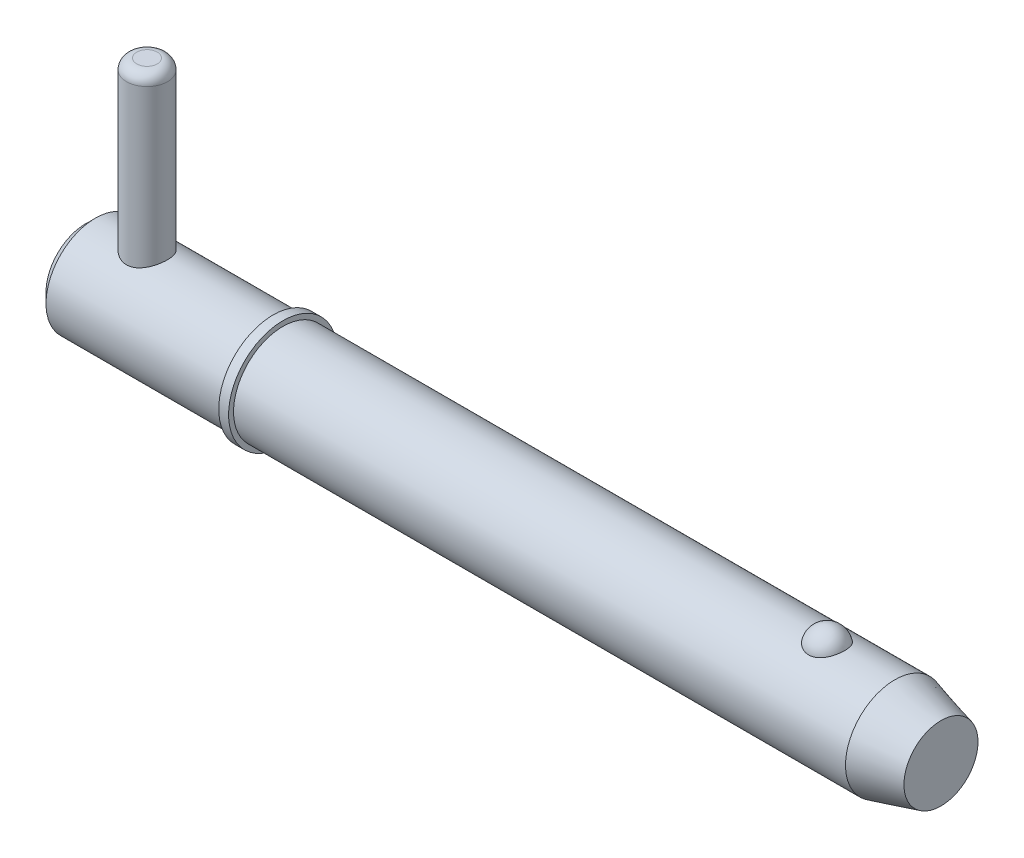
ISO-10303-21;
HEADER;
FILE_DESCRIPTION(('STEP AP214'),'2;1');
FILE_NAME('part.step','',(''),(''),'','','');
FILE_SCHEMA(('AUTOMOTIVE_DESIGN { 1 0 10303 214 1 1 1 1 }'));
ENDSEC;
DATA;
#1=APPLICATION_CONTEXT('core data for automotive mechanical design processes');
#2=APPLICATION_PROTOCOL_DEFINITION('international standard','automotive_design',2000,#1);
#3=PRODUCT_CONTEXT('',#1,'mechanical');
#4=PRODUCT('Part','Part','',(#3));
#5=PRODUCT_RELATED_PRODUCT_CATEGORY('part','',(#4));
#6=PRODUCT_DEFINITION_FORMATION('','',#4);
#7=PRODUCT_DEFINITION_CONTEXT('part definition',#1,'design');
#8=PRODUCT_DEFINITION('design','',#6,#7);
#9=PRODUCT_DEFINITION_SHAPE('','',#8);
#10=(LENGTH_UNIT() NAMED_UNIT(*) SI_UNIT(.MILLI.,.METRE.));
#11=(NAMED_UNIT(*) PLANE_ANGLE_UNIT() SI_UNIT($,.RADIAN.));
#12=(NAMED_UNIT(*) SI_UNIT($,.STERADIAN.) SOLID_ANGLE_UNIT());
#13=UNCERTAINTY_MEASURE_WITH_UNIT(LENGTH_MEASURE(1.E-05),#10,'distance_accuracy_value','');
#14=(GEOMETRIC_REPRESENTATION_CONTEXT(3) GLOBAL_UNCERTAINTY_ASSIGNED_CONTEXT((#13)) GLOBAL_UNIT_ASSIGNED_CONTEXT((#10,
#11,#12)) REPRESENTATION_CONTEXT('',''));
#15=CARTESIAN_POINT('',(0.,0.,0.));
#16=DIRECTION('',(0.,0.,1.));
#17=DIRECTION('',(1.,0.,0.));
#18=AXIS2_PLACEMENT_3D('',#15,#16,#17);
#19=CARTESIAN_POINT('',(5.94,20.635,0.));
#20=DIRECTION('',(0.,-1.,0.));
#21=DIRECTION('',(0.,0.,-1.));
#22=AXIS2_PLACEMENT_3D('',#19,#20,#21);
#23=CYLINDRICAL_SURFACE('',#22,1.98);
#24=CARTESIAN_POINT('',(5.94,-3.775,0.));
#25=DIRECTION('',(0.,1.,0.));
#26=DIRECTION('',(0.,0.,1.));
#27=AXIS2_PLACEMENT_3D('',#24,#25,#26);
#28=CIRCLE('',#27,1.98);
#29=CARTESIAN_POINT('',(5.94,-3.775,1.98));
#30=VERTEX_POINT('',#29);
#31=EDGE_CURVE('P0_E25',#30,#30,#28,.T.);
#32=ORIENTED_EDGE('',*,*,#31,.T.);
#33=EDGE_LOOP('',(#32));
#34=FACE_BOUND('',#33,.T.);
#35=CARTESIAN_POINT('',(5.94,19.645,0.));
#36=DIRECTION('',(0.,1.,0.));
#37=DIRECTION('',(0.,0.,1.));
#38=AXIS2_PLACEMENT_3D('',#35,#36,#37);
#39=CIRCLE('',#38,1.98);
#40=CARTESIAN_POINT('',(5.94,19.645,1.98));
#41=VERTEX_POINT('',#40);
#42=EDGE_CURVE('P0_E29',#41,#41,#39,.F.);
#43=ORIENTED_EDGE('',*,*,#42,.T.);
#44=EDGE_LOOP('',(#43));
#45=FACE_BOUND('',#44,.T.);
#46=ADVANCED_FACE('P0_F14',(#34,#45),#23,.T.);
#47=CARTESIAN_POINT('',(5.94,20.635,0.));
#48=DIRECTION('',(0.,1.,0.));
#49=DIRECTION('',(0.,0.,1.));
#50=AXIS2_PLACEMENT_3D('',#47,#48,#49);
#51=PLANE('',#50);
#52=CARTESIAN_POINT('',(5.94,20.635,0.));
#53=DIRECTION('',(0.,1.,0.));
#54=DIRECTION('',(0.,0.,1.));
#55=AXIS2_PLACEMENT_3D('',#52,#53,#54);
#56=CIRCLE('',#55,0.99);
#57=CARTESIAN_POINT('',(5.94,20.635,0.99));
#58=VERTEX_POINT('',#57);
#59=EDGE_CURVE('P0_E10',#58,#58,#56,.T.);
#60=ORIENTED_EDGE('',*,*,#59,.T.);
#61=EDGE_LOOP('',(#60));
#62=FACE_BOUND('',#61,.T.);
#63=ADVANCED_FACE('P0_F46',(#62),#51,.T.);
#64=CARTESIAN_POINT('',(5.94,-4.765,0.));
#65=DIRECTION('',(0.,1.,0.));
#66=DIRECTION('',(0.,0.,1.));
#67=AXIS2_PLACEMENT_3D('',#64,#65,#66);
#68=PLANE('',#67);
#69=CARTESIAN_POINT('',(5.94,-4.765,0.));
#70=DIRECTION('',(0.,1.,0.));
#71=DIRECTION('',(0.,0.,1.));
#72=AXIS2_PLACEMENT_3D('',#69,#70,#71);
#73=CIRCLE('',#72,0.99);
#74=CARTESIAN_POINT('',(5.94,-4.765,0.99));
#75=VERTEX_POINT('',#74);
#76=EDGE_CURVE('P0_E21',#75,#75,#73,.F.);
#77=ORIENTED_EDGE('',*,*,#76,.T.);
#78=EDGE_LOOP('',(#77));
#79=FACE_BOUND('',#78,.T.);
#80=ADVANCED_FACE('P0_F43',(#79),#68,.F.);
#81=CARTESIAN_POINT('',(5.94,-3.775,0.));
#82=DIRECTION('',(0.,1.,0.));
#83=DIRECTION('',(0.,0.,1.));
#84=AXIS2_PLACEMENT_3D('',#81,#82,#83);
#85=DEGENERATE_TOROIDAL_SURFACE('',#84,0.99,0.99,.T.);
#86=ORIENTED_EDGE('',*,*,#76,.F.);
#87=EDGE_LOOP('',(#86));
#88=FACE_BOUND('',#87,.T.);
#89=ORIENTED_EDGE('',*,*,#31,.F.);
#90=EDGE_LOOP('',(#89));
#91=FACE_BOUND('',#90,.T.);
#92=ADVANCED_FACE('P0_F38',(#88,#91),#85,.T.);
#93=CARTESIAN_POINT('',(5.94,19.645,0.));
#94=DIRECTION('',(0.,1.,0.));
#95=DIRECTION('',(0.,0.,1.));
#96=AXIS2_PLACEMENT_3D('',#93,#94,#95);
#97=DEGENERATE_TOROIDAL_SURFACE('',#96,0.99,0.99,.T.);
#98=ORIENTED_EDGE('',*,*,#42,.F.);
#99=EDGE_LOOP('',(#98));
#100=FACE_BOUND('',#99,.T.);
#101=ORIENTED_EDGE('',*,*,#59,.F.);
#102=EDGE_LOOP('',(#101));
#103=FACE_BOUND('',#102,.T.);
#104=ADVANCED_FACE('P0_F16',(#100,#103),#97,.T.);
#105=CLOSED_SHELL('',(#46,#63,#80,#92,#104));
#106=MANIFOLD_SOLID_BREP('P0_B1',#105);
#107=CARTESIAN_POINT('',(0.,0.,0.));
#108=DIRECTION('',(1.,0.,0.));
#109=DIRECTION('',(0.,0.,-1.));
#110=AXIS2_PLACEMENT_3D('',#107,#108,#109);
#111=CYLINDRICAL_SURFACE('',#110,4.765);
#112=CARTESIAN_POINT('',(78.1041944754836,0.,0.));
#113=DIRECTION('',(1.,0.,0.));
#114=DIRECTION('',(0.,0.,-1.));
#115=AXIS2_PLACEMENT_3D('',#112,#113,#114);
#116=CIRCLE('',#115,4.765);
#117=CARTESIAN_POINT('',(78.1041944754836,0.,-4.765));
#118=VERTEX_POINT('',#117);
#119=EDGE_CURVE('P1_E81',#118,#118,#116,.T.);
#120=ORIENTED_EDGE('',*,*,#119,.F.);
#121=EDGE_LOOP('',(#120));
#122=FACE_BOUND('',#121,.T.);
#123=CARTESIAN_POINT('',(19.05,0.,0.));
#124=DIRECTION('',(1.,0.,0.));
#125=DIRECTION('',(0.,0.,-1.));
#126=AXIS2_PLACEMENT_3D('',#123,#124,#125);
#127=CIRCLE('',#126,4.765);
#128=CARTESIAN_POINT('',(19.05,0.,-4.765));
#129=VERTEX_POINT('',#128);
#130=EDGE_CURVE('P1_E85',#129,#129,#127,.T.);
#131=ORIENTED_EDGE('',*,*,#130,.T.);
#132=EDGE_LOOP('',(#131));
#133=FACE_BOUND('',#132,.T.);
#134=CARTESIAN_POINT('',(71.551020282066,4.42764777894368,1.76101111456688));
#135=CARTESIAN_POINT('',(71.4597212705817,4.42764470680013,1.76101422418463));
#136=CARTESIAN_POINT('',(71.3684468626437,4.43059091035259,1.75366340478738));
#137=CARTESIAN_POINT('',(71.188615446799,4.44201846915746,1.72451180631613));
#138=CARTESIAN_POINT('',(71.1000577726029,4.45049845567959,1.70271460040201));
#139=CARTESIAN_POINT('',(70.9282570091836,4.47200516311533,1.6453937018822));
#140=CARTESIAN_POINT('',(70.8450064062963,4.48502527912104,1.60988994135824));
#141=CARTESIAN_POINT('',(70.6857633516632,4.51419542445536,1.52617873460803));
#142=CARTESIAN_POINT('',(70.6097723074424,4.53034605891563,1.47796883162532));
#143=CARTESIAN_POINT('',(70.4647445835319,4.5645931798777,1.36860494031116));
#144=CARTESIAN_POINT('',(70.3959645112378,4.58273170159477,1.30712420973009));
#145=CARTESIAN_POINT('',(70.2693423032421,4.61870302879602,1.17370204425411));
#146=CARTESIAN_POINT('',(70.2115021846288,4.63653577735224,1.1017586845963));
#147=CARTESIAN_POINT('',(70.1055709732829,4.67090140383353,0.945806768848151));
#148=CARTESIAN_POINT('',(70.0580305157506,4.68734068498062,0.861402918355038));
#149=CARTESIAN_POINT('',(69.9770817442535,4.71628466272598,0.685442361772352));
#150=CARTESIAN_POINT('',(69.9436747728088,4.72878898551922,0.59388497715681));
#151=CARTESIAN_POINT('',(69.891287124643,4.74874061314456,0.40478128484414));
#152=CARTESIAN_POINT('',(69.8725178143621,4.75611366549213,0.307168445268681));
#153=CARTESIAN_POINT('',(69.8505846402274,4.76475393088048,0.109940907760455));
#154=CARTESIAN_POINT('',(69.8474205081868,4.76602124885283,0.0103262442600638));
#155=CARTESIAN_POINT('',(69.8567405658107,4.76232928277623,-0.187629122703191));
#156=CARTESIAN_POINT('',(69.8691588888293,4.7573962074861,-0.285973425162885));
#157=CARTESIAN_POINT('',(69.9092804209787,4.74184975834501,-0.479027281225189));
#158=CARTESIAN_POINT('',(69.9369839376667,4.7312362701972,-0.573736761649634));
#159=CARTESIAN_POINT('',(70.0071581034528,4.70540026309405,-0.756973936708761));
#160=CARTESIAN_POINT('',(70.0496460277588,4.69017235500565,-0.84549425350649));
#161=CARTESIAN_POINT('',(70.148520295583,4.6566986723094,-1.01378033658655));
#162=CARTESIAN_POINT('',(70.2049076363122,4.63845268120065,-1.09354547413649));
#163=CARTESIAN_POINT('',(70.330552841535,4.60085438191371,-1.24228523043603));
#164=CARTESIAN_POINT('',(70.3998439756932,4.58149930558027,-1.31123108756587));
#165=CARTESIAN_POINT('',(70.5496066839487,4.54391653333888,-1.43607409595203));
#166=CARTESIAN_POINT('',(70.6300771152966,4.52568872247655,-1.49197257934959));
#167=CARTESIAN_POINT('',(70.7981500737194,4.49293007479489,-1.58786764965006));
#168=CARTESIAN_POINT('',(70.8855445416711,4.47832346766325,-1.62820219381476));
#169=CARTESIAN_POINT('',(71.066553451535,4.45406011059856,-1.69345757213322));
#170=CARTESIAN_POINT('',(71.1601655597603,4.44440151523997,-1.71838415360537));
#171=CARTESIAN_POINT('',(71.3458939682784,4.43159888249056,-1.75112843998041));
#172=CARTESIAN_POINT('',(71.437849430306,4.42815213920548,-1.75974223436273));
#173=CARTESIAN_POINT('',(71.6219658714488,4.427247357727,-1.76201865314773));
#174=CARTESIAN_POINT('',(71.7141268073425,4.42978816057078,-1.7556841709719));
#175=CARTESIAN_POINT('',(71.8931292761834,4.4403864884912,-1.72869560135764));
#176=CARTESIAN_POINT('',(71.9800474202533,4.44827555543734,-1.70847853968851));
#177=CARTESIAN_POINT('',(72.1491314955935,4.46852246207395,-1.65479562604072));
#178=CARTESIAN_POINT('',(72.2312970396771,4.48088066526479,-1.62132869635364));
#179=CARTESIAN_POINT('',(72.3905916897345,4.50907357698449,-1.54120560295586));
#180=CARTESIAN_POINT('',(72.4675700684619,4.52497884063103,-1.49427526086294));
#181=CARTESIAN_POINT('',(72.6127080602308,4.55845148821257,-1.38881222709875));
#182=CARTESIAN_POINT('',(72.6808656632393,4.57601924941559,-1.33027689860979));
#183=CARTESIAN_POINT('',(72.8100990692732,4.61196537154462,-1.19991049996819));
#184=CARTESIAN_POINT('',(72.8706562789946,4.63034074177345,-1.12756415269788));
#185=CARTESIAN_POINT('',(72.9792797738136,4.66513959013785,-0.973612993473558));
#186=CARTESIAN_POINT('',(73.0273438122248,4.68156271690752,-0.892006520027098));
#187=CARTESIAN_POINT('',(73.111383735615,4.71130224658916,-0.718892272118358));
#188=CARTESIAN_POINT('',(73.1469185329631,4.724501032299,-0.627149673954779));
#189=CARTESIAN_POINT('',(73.2029522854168,4.74571823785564,-0.43861154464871));
#190=CARTESIAN_POINT('',(73.223450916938,4.75373654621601,-0.341815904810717));
#191=CARTESIAN_POINT('',(73.2490338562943,4.76378905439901,-0.145633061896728));
#192=CARTESIAN_POINT('',(73.254076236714,4.76580697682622,-0.0462395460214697));
#193=CARTESIAN_POINT('',(73.2485239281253,4.76360573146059,0.152038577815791));
#194=CARTESIAN_POINT('',(73.2379294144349,4.75938663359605,0.250923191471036));
#195=CARTESIAN_POINT('',(73.2013875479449,4.74516937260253,0.445004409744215));
#196=CARTESIAN_POINT('',(73.1754964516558,4.73519238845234,0.540213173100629));
#197=CARTESIAN_POINT('',(73.1089273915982,4.7104939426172,0.724662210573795));
#198=CARTESIAN_POINT('',(73.068248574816,4.69577220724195,0.813902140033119));
#199=CARTESIAN_POINT('',(72.9727177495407,4.66303767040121,0.984313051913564));
#200=CARTESIAN_POINT('',(72.9178042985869,4.64501070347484,1.06544688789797));
#201=CARTESIAN_POINT('',(72.7950496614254,4.60764678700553,1.21692673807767));
#202=CARTESIAN_POINT('',(72.7272086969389,4.58830985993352,1.2872729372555));
#203=CARTESIAN_POINT('',(72.5805480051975,4.55060370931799,1.41479271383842));
#204=CARTESIAN_POINT('',(72.5017918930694,4.53222967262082,1.47203785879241));
#205=CARTESIAN_POINT('',(72.3349890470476,4.49849576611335,1.57212016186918));
#206=CARTESIAN_POINT('',(72.2469417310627,4.48313608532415,1.61495641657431));
#207=CARTESIAN_POINT('',(72.0597918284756,4.45676184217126,1.68642657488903));
#208=CARTESIAN_POINT('',(71.9603653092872,4.44598302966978,1.71430590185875));
#209=CARTESIAN_POINT('',(71.7576210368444,4.43142918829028,1.75159258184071));
#210=CARTESIAN_POINT('',(71.6543049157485,4.42765125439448,1.76100759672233));
#211=CARTESIAN_POINT('',(71.551020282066,4.42764777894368,1.76101111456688));
#212=B_SPLINE_CURVE_WITH_KNOTS('',3,(#134,#135,#136,#137,#138,#139,#140,#141,#142,#143,#144,
#145,#146,#147,#148,#149,#150,#151,#152,#153,#154,#155,#156,#157,#158,#159,#160,#161,#162,#163,
#164,#165,#166,#167,#168,#169,#170,#171,#172,#173,#174,#175,#176,#177,#178,#179,#180,#181,#182,
#183,#184,#185,#186,#187,#188,#189,#190,#191,#192,#193,#194,#195,#196,#197,#198,#199,#200,#201,
#202,#203,#204,#205,#206,#207,#208,#209,#210,#211),.UNSPECIFIED.,.T.,.F.,(4,2,2,2,2,2,2,2,2,2,2,
2,2,2,2,2,2,2,2,2,2,2,2,2,2,2,2,2,2,2,2,2,2,2,2,2,2,2,4),(0.,0.273517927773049,
0.546968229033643,0.820022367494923,1.09312934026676,1.37393946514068,1.65480131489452,
1.94820420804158,2.24163496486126,2.53922817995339,2.8368162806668,3.13315071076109,
3.42949110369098,3.72617893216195,4.02288805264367,4.32037303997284,4.61782764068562,
4.9084009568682,5.19886582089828,5.4747485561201,5.75057789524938,6.01809977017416,
6.2856434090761,6.55907787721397,6.83257454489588,7.11962987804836,7.40673679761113,
7.70312663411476,7.99952284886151,8.29672237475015,8.59391856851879,8.89002850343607,
9.18615552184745,9.483582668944,9.78100471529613,10.0767610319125,10.3725358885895,
10.6820893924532,10.991514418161),.UNSPECIFIED.);
#213=CARTESIAN_POINT('',(71.551020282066,4.42764777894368,1.76101111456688));
#214=VERTEX_POINT('',#213);
#215=EDGE_CURVE('P1_E35',#214,#214,#212,.T.);
#216=ORIENTED_EDGE('',*,*,#215,.T.);
#217=EDGE_LOOP('',(#216));
#218=FACE_BOUND('',#217,.T.);
#219=ADVANCED_FACE('P1_F13',(#122,#133,#218),#111,.T.);
#220=CARTESIAN_POINT('',(0.,0.,0.));
#221=DIRECTION('',(-1.,0.,0.));
#222=DIRECTION('',(0.,0.,1.));
#223=AXIS2_PLACEMENT_3D('',#220,#221,#222);
#224=PLANE('',#223);
#225=CARTESIAN_POINT('',(0.,0.,0.));
#226=DIRECTION('',(1.,0.,0.));
#227=DIRECTION('',(0.,0.,-1.));
#228=AXIS2_PLACEMENT_3D('',#225,#226,#227);
#229=CIRCLE('',#228,3.812);
#230=CARTESIAN_POINT('',(0.,0.,-3.812));
#231=VERTEX_POINT('',#230);
#232=EDGE_CURVE('P1_E9',#231,#231,#229,.T.);
#233=ORIENTED_EDGE('',*,*,#232,.F.);
#234=EDGE_LOOP('',(#233));
#235=FACE_BOUND('',#234,.T.);
#236=ADVANCED_FACE('P1_F15',(#235),#224,.T.);
#237=CARTESIAN_POINT('',(0.952999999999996,0.,0.));
#238=DIRECTION('',(1.,0.,0.));
#239=DIRECTION('',(0.,0.,-1.));
#240=AXIS2_PLACEMENT_3D('',#237,#238,#239);
#241=CONICAL_SURFACE('',#240,4.765,0.78539816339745);
#242=ORIENTED_EDGE('',*,*,#232,.T.);
#243=EDGE_LOOP('',(#242));
#244=FACE_BOUND('',#243,.T.);
#245=CARTESIAN_POINT('',(0.952999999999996,0.,0.));
#246=DIRECTION('',(1.,0.,0.));
#247=DIRECTION('',(0.,0.,-1.));
#248=AXIS2_PLACEMENT_3D('',#245,#246,#247);
#249=CIRCLE('',#248,4.765);
#250=CARTESIAN_POINT('',(0.952999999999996,0.,-4.765));
#251=VERTEX_POINT('',#250);
#252=EDGE_CURVE('P1_E26',#251,#251,#249,.T.);
#253=ORIENTED_EDGE('',*,*,#252,.F.);
#254=EDGE_LOOP('',(#253));
#255=FACE_BOUND('',#254,.T.);
#256=ADVANCED_FACE('P1_F77',(#244,#255),#241,.T.);
#257=CARTESIAN_POINT('',(0.,0.,0.));
#258=DIRECTION('',(1.,0.,0.));
#259=DIRECTION('',(0.,0.,-1.));
#260=AXIS2_PLACEMENT_3D('',#257,#258,#259);
#261=CYLINDRICAL_SURFACE('',#260,4.765);
#262=CARTESIAN_POINT('',(5.94,-4.33414639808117,1.98));
#263=CARTESIAN_POINT('',(5.83435484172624,-4.33415447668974,1.97999169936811));
#264=CARTESIAN_POINT('',(5.72854887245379,-4.33806396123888,1.97149330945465));
#265=CARTESIAN_POINT('',(5.51998191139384,-4.35319906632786,1.93783487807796));
#266=CARTESIAN_POINT('',(5.41723000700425,-4.3644446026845,1.91262947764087));
#267=CARTESIAN_POINT('',(5.21817294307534,-4.39274225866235,1.84670269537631));
#268=CARTESIAN_POINT('',(5.12184344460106,-4.40977076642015,1.80604432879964));
#269=CARTESIAN_POINT('',(4.93740039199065,-4.44768106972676,1.71055160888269));
#270=CARTESIAN_POINT('',(4.84928487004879,-4.46856193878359,1.65572066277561));
#271=CARTESIAN_POINT('',(4.67826533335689,-4.51326966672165,1.52981120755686));
#272=CARTESIAN_POINT('',(4.59593118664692,-4.53719608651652,1.45799365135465));
#273=CARTESIAN_POINT('',(4.44405452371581,-4.58448035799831,1.30170177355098));
#274=CARTESIAN_POINT('',(4.37451692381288,-4.60783798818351,1.21722260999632));
#275=CARTESIAN_POINT('',(4.24730683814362,-4.65256187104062,1.03353484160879));
#276=CARTESIAN_POINT('',(4.19027484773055,-4.67379892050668,0.933848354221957));
#277=CARTESIAN_POINT('',(4.0940363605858,-4.7106711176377,0.7252544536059));
#278=CARTESIAN_POINT('',(4.05482199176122,-4.72630873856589,0.61635113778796));
#279=CARTESIAN_POINT('',(3.99739515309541,-4.74951416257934,0.398397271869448));
#280=CARTESIAN_POINT('',(3.97820018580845,-4.7574579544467,0.289646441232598));
#281=CARTESIAN_POINT('',(3.95818309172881,-4.76574596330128,0.0701967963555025));
#282=CARTESIAN_POINT('',(3.95735355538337,-4.76609324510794,-0.0405012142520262));
#283=CARTESIAN_POINT('',(3.9735743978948,-4.75937098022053,-0.253561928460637));
#284=CARTESIAN_POINT('',(3.98954548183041,-4.75274912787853,-0.356023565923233));
#285=CARTESIAN_POINT('',(4.03706504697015,-4.73344665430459,-0.556659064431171));
#286=CARTESIAN_POINT('',(4.06861467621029,-4.72076558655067,-0.654832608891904));
#287=CARTESIAN_POINT('',(4.14677192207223,-4.69032846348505,-0.845904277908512));
#288=CARTESIAN_POINT('',(4.19360181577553,-4.67249797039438,-0.938699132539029));
#289=CARTESIAN_POINT('',(4.30077315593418,-4.63350852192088,-1.11535616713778));
#290=CARTESIAN_POINT('',(4.3611193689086,-4.61234839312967,-1.19921518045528));
#291=CARTESIAN_POINT('',(4.49853487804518,-4.56707259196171,-1.3618711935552));
#292=CARTESIAN_POINT('',(4.57648039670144,-4.5428537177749,-1.43990029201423));
#293=CARTESIAN_POINT('',(4.74440779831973,-4.49530722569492,-1.58211009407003));
#294=CARTESIAN_POINT('',(4.83439425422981,-4.47197995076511,-1.64628551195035));
#295=CARTESIAN_POINT('',(5.02755026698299,-4.42812342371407,-1.76092221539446));
#296=CARTESIAN_POINT('',(5.13105348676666,-4.40770990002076,-1.81086937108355));
#297=CARTESIAN_POINT('',(5.34607555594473,-4.37336901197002,-1.89231211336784));
#298=CARTESIAN_POINT('',(5.45758864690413,-4.3594370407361,-1.92382080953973));
#299=CARTESIAN_POINT('',(5.67777275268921,-4.34077746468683,-1.96554536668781));
#300=CARTESIAN_POINT('',(5.78616167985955,-4.33551319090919,-1.9770057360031));
#301=CARTESIAN_POINT('',(6.00341835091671,-4.33325118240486,-1.98196183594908));
#302=CARTESIAN_POINT('',(6.11228591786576,-4.33625061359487,-1.97546372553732));
#303=CARTESIAN_POINT('',(6.32012423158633,-4.34962383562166,-1.94582288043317));
#304=CARTESIAN_POINT('',(6.41928436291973,-4.35951709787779,-1.92376364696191));
#305=CARTESIAN_POINT('',(6.61241543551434,-4.38495043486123,-1.86506038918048));
#306=CARTESIAN_POINT('',(6.70638516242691,-4.40049182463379,-1.82841296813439));
#307=CARTESIAN_POINT('',(6.89090272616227,-4.43627016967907,-1.73985559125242));
#308=CARTESIAN_POINT('',(6.98113841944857,-4.45667771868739,-1.68736639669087));
#309=CARTESIAN_POINT('',(7.1519532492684,-4.49964530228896,-1.56919282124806));
#310=CARTESIAN_POINT('',(7.232528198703,-4.52220626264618,-1.50350275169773));
#311=CARTESIAN_POINT('',(7.38851617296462,-4.56914071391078,-1.35452895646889));
#312=CARTESIAN_POINT('',(7.46298462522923,-4.5935132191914,-1.27025197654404));
#313=CARTESIAN_POINT('',(7.59689029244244,-4.63962841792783,-1.08983181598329));
#314=CARTESIAN_POINT('',(7.65632644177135,-4.66137092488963,-0.993687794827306));
#315=CARTESIAN_POINT('',(7.75840361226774,-4.69991192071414,-0.791608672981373));
#316=CARTESIAN_POINT('',(7.80100481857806,-4.71669866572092,-0.685651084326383));
#317=CARTESIAN_POINT('',(7.86746997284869,-4.74331408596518,-0.467197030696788));
#318=CARTESIAN_POINT('',(7.8913450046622,-4.75314687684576,-0.354704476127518));
#319=CARTESIAN_POINT('',(7.91828971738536,-4.76427543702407,-0.134819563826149));
#320=CARTESIAN_POINT('',(7.92269147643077,-4.76611762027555,-0.027616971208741));
#321=CARTESIAN_POINT('',(7.91414154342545,-4.76256684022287,0.185959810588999));
#322=CARTESIAN_POINT('',(7.90119286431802,-4.75717513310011,0.292334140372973));
#323=CARTESIAN_POINT('',(7.85926572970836,-4.74004856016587,0.497383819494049));
#324=CARTESIAN_POINT('',(7.83086647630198,-4.72854322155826,0.596198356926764));
#325=CARTESIAN_POINT('',(7.75947503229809,-4.70045111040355,0.787624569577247));
#326=CARTESIAN_POINT('',(7.71648006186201,-4.68386336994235,0.880235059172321));
#327=CARTESIAN_POINT('',(7.6149456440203,-4.64628321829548,1.06122875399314));
#328=CARTESIAN_POINT('',(7.55579211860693,-4.62512577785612,1.14923242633));
#329=CARTESIAN_POINT('',(7.42451813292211,-4.58091700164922,1.31443888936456));
#330=CARTESIAN_POINT('',(7.35239289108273,-4.5578649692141,1.39163767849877));
#331=CARTESIAN_POINT('',(7.19146107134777,-4.51050832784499,1.53847013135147));
#332=CARTESIAN_POINT('',(7.10185635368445,-4.48622440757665,1.60723941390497));
#333=CARTESIAN_POINT('',(6.91164948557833,-4.44076541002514,1.72888900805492));
#334=CARTESIAN_POINT('',(6.81104124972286,-4.41959206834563,1.78176046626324));
#335=CARTESIAN_POINT('',(6.60181953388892,-4.38318936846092,1.86953227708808));
#336=CARTESIAN_POINT('',(6.49325511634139,-4.3679267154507,1.90453365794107));
#337=CARTESIAN_POINT('',(6.32681512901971,-4.35102038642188,1.94268459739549));
#338=CARTESIAN_POINT('',(6.27079191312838,-4.34638447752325,1.953006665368));
#339=CARTESIAN_POINT('',(6.15793999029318,-4.33925923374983,1.96879053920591));
#340=CARTESIAN_POINT('',(6.10111188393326,-4.33676837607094,1.97425579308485));
#341=CARTESIAN_POINT('',(6.00947316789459,-4.33456308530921,1.97908711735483));
#342=CARTESIAN_POINT('',(5.97474528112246,-4.33414374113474,1.98000272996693));
#343=CARTESIAN_POINT('',(5.94,-4.33414639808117,1.98));
#344=B_SPLINE_CURVE_WITH_KNOTS('',3,(#262,#263,#264,#265,#266,#267,#268,#269,#270,#271,#272,
#273,#274,#275,#276,#277,#278,#279,#280,#281,#282,#283,#284,#285,#286,#287,#288,#289,#290,#291,
#292,#293,#294,#295,#296,#297,#298,#299,#300,#301,#302,#303,#304,#305,#306,#307,#308,#309,#310,
#311,#312,#313,#314,#315,#316,#317,#318,#319,#320,#321,#322,#323,#324,#325,#326,#327,#328,#329,
#330,#331,#332,#333,#334,#335,#336,#337,#338,#339,#340,#341,#342,#343),.UNSPECIFIED.,.T.,.F.,(4,
2,2,2,2,2,2,2,2,2,2,2,2,2,2,2,2,2,2,2,2,2,2,2,2,2,2,2,2,2,2,2,2,2,2,2,2,2,2,2,4),(0.,
0.316814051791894,0.634491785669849,0.950887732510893,1.2672076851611,1.60127705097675,
1.93547449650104,2.28407463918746,2.63252061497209,2.96292077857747,3.29318763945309,
3.60346227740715,3.91375978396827,4.22878888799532,4.54392926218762,4.88117914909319,
5.21855748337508,5.56691259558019,5.91501972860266,6.24062939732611,6.56612741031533,
6.87094948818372,7.17584258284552,7.49361276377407,7.81152017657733,8.15513975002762,
8.4987836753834,8.8432355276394,9.18748334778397,9.50777781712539,9.8280166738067,
10.1370037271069,10.4460496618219,10.7690461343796,11.0921619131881,11.4371238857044,
11.7822776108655,12.1254577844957,12.2967183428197,12.4678572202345,12.5720531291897),.UNSPECIFIED.);
#345=CARTESIAN_POINT('',(5.94,-4.33414639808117,1.98));
#346=VERTEX_POINT('',#345);
#347=EDGE_CURVE('P1_E17',#346,#346,#344,.T.);
#348=ORIENTED_EDGE('',*,*,#347,.F.);
#349=EDGE_LOOP('',(#348));
#350=FACE_BOUND('',#349,.T.);
#351=CARTESIAN_POINT('',(5.94,4.33414639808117,1.98));
#352=CARTESIAN_POINT('',(6.04564515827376,4.33415447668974,1.97999169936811));
#353=CARTESIAN_POINT('',(6.15145112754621,4.33806396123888,1.97149330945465));
#354=CARTESIAN_POINT('',(6.36001808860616,4.35319906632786,1.93783487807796));
#355=CARTESIAN_POINT('',(6.46276999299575,4.3644446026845,1.91262947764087));
#356=CARTESIAN_POINT('',(6.66182705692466,4.39274225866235,1.84670269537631));
#357=CARTESIAN_POINT('',(6.75815655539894,4.40977076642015,1.80604432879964));
#358=CARTESIAN_POINT('',(6.94259960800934,4.44768106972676,1.71055160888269));
#359=CARTESIAN_POINT('',(7.03071512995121,4.46856193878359,1.65572066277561));
#360=CARTESIAN_POINT('',(7.20173466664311,4.51326966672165,1.52981120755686));
#361=CARTESIAN_POINT('',(7.28406881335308,4.53719608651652,1.45799365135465));
#362=CARTESIAN_POINT('',(7.43594547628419,4.58448035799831,1.30170177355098));
#363=CARTESIAN_POINT('',(7.50548307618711,4.60783798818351,1.21722260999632));
#364=CARTESIAN_POINT('',(7.63269316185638,4.65256187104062,1.03353484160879));
#365=CARTESIAN_POINT('',(7.68972515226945,4.67379892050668,0.933848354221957));
#366=CARTESIAN_POINT('',(7.7859636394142,4.7106711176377,0.7252544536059));
#367=CARTESIAN_POINT('',(7.82517800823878,4.72630873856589,0.61635113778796));
#368=CARTESIAN_POINT('',(7.88260484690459,4.74951416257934,0.398397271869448));
#369=CARTESIAN_POINT('',(7.90179981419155,4.7574579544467,0.289646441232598));
#370=CARTESIAN_POINT('',(7.92181690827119,4.76574596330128,0.0701967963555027));
#371=CARTESIAN_POINT('',(7.92264644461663,4.76609324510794,-0.040501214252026));
#372=CARTESIAN_POINT('',(7.9064256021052,4.75937098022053,-0.253561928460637));
#373=CARTESIAN_POINT('',(7.89045451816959,4.75274912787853,-0.356023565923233));
#374=CARTESIAN_POINT('',(7.84293495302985,4.73344665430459,-0.55665906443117));
#375=CARTESIAN_POINT('',(7.81138532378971,4.72076558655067,-0.654832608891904));
#376=CARTESIAN_POINT('',(7.73322807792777,4.69032846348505,-0.845904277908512));
#377=CARTESIAN_POINT('',(7.68639818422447,4.67249797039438,-0.938699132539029));
#378=CARTESIAN_POINT('',(7.57922684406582,4.63350852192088,-1.11535616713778));
#379=CARTESIAN_POINT('',(7.5188806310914,4.61234839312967,-1.19921518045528));
#380=CARTESIAN_POINT('',(7.38146512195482,4.56707259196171,-1.3618711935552));
#381=CARTESIAN_POINT('',(7.30351960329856,4.5428537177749,-1.43990029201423));
#382=CARTESIAN_POINT('',(7.13559220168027,4.49530722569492,-1.58211009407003));
#383=CARTESIAN_POINT('',(7.04560574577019,4.47197995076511,-1.64628551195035));
#384=CARTESIAN_POINT('',(6.85244973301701,4.42812342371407,-1.76092221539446));
#385=CARTESIAN_POINT('',(6.74894651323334,4.40770990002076,-1.81086937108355));
#386=CARTESIAN_POINT('',(6.53392444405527,4.37336901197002,-1.89231211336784));
#387=CARTESIAN_POINT('',(6.42241135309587,4.3594370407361,-1.92382080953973));
#388=CARTESIAN_POINT('',(6.20222724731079,4.34077746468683,-1.96554536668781));
#389=CARTESIAN_POINT('',(6.09383832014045,4.33551319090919,-1.9770057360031));
#390=CARTESIAN_POINT('',(5.87658164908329,4.33325118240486,-1.98196183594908));
#391=CARTESIAN_POINT('',(5.76771408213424,4.33625061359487,-1.97546372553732));
#392=CARTESIAN_POINT('',(5.55987576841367,4.34962383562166,-1.94582288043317));
#393=CARTESIAN_POINT('',(5.46071563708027,4.35951709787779,-1.92376364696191));
#394=CARTESIAN_POINT('',(5.26758456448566,4.38495043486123,-1.86506038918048));
#395=CARTESIAN_POINT('',(5.17361483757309,4.40049182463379,-1.82841296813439));
#396=CARTESIAN_POINT('',(4.98909727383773,4.43627016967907,-1.73985559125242));
#397=CARTESIAN_POINT('',(4.89886158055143,4.45667771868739,-1.68736639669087));
#398=CARTESIAN_POINT('',(4.72804675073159,4.49964530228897,-1.56919282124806));
#399=CARTESIAN_POINT('',(4.647471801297,4.52220626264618,-1.50350275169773));
#400=CARTESIAN_POINT('',(4.49148382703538,4.56914071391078,-1.35452895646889));
#401=CARTESIAN_POINT('',(4.41701537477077,4.5935132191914,-1.27025197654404));
#402=CARTESIAN_POINT('',(4.28310970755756,4.63962841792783,-1.08983181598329));
#403=CARTESIAN_POINT('',(4.22367355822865,4.66137092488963,-0.993687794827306));
#404=CARTESIAN_POINT('',(4.12159638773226,4.69991192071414,-0.791608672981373));
#405=CARTESIAN_POINT('',(4.07899518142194,4.71669866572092,-0.685651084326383));
#406=CARTESIAN_POINT('',(4.01253002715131,4.74331408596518,-0.467197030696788));
#407=CARTESIAN_POINT('',(3.98865499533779,4.75314687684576,-0.354704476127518));
#408=CARTESIAN_POINT('',(3.96171028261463,4.76427543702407,-0.134819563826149));
#409=CARTESIAN_POINT('',(3.95730852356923,4.76611762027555,-0.0276169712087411));
#410=CARTESIAN_POINT('',(3.96585845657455,4.76256684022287,0.185959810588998));
#411=CARTESIAN_POINT('',(3.97880713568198,4.75717513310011,0.292334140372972));
#412=CARTESIAN_POINT('',(4.02073427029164,4.74004856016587,0.497383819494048));
#413=CARTESIAN_POINT('',(4.04913352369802,4.72854322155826,0.596198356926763));
#414=CARTESIAN_POINT('',(4.12052496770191,4.70045111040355,0.787624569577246));
#415=CARTESIAN_POINT('',(4.16351993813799,4.68386336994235,0.880235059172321));
#416=CARTESIAN_POINT('',(4.2650543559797,4.64628321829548,1.06122875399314));
#417=CARTESIAN_POINT('',(4.32420788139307,4.62512577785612,1.14923242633));
#418=CARTESIAN_POINT('',(4.45548186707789,4.58091700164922,1.31443888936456));
#419=CARTESIAN_POINT('',(4.52760710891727,4.5578649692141,1.39163767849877));
#420=CARTESIAN_POINT('',(4.68853892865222,4.51050832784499,1.53847013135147));
#421=CARTESIAN_POINT('',(4.77814364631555,4.48622440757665,1.60723941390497));
#422=CARTESIAN_POINT('',(4.96835051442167,4.44076541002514,1.72888900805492));
#423=CARTESIAN_POINT('',(5.06895875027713,4.41959206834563,1.78176046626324));
#424=CARTESIAN_POINT('',(5.27818046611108,4.38318936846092,1.86953227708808));
#425=CARTESIAN_POINT('',(5.38674488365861,4.3679267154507,1.90453365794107));
#426=CARTESIAN_POINT('',(5.55318487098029,4.35102038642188,1.94268459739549));
#427=CARTESIAN_POINT('',(5.60920808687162,4.34638447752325,1.953006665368));
#428=CARTESIAN_POINT('',(5.72206000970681,4.33925923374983,1.96879053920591));
#429=CARTESIAN_POINT('',(5.77888811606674,4.33676837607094,1.97425579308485));
#430=CARTESIAN_POINT('',(5.87052683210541,4.33456308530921,1.97908711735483));
#431=CARTESIAN_POINT('',(5.90525471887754,4.33414374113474,1.98000272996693));
#432=CARTESIAN_POINT('',(5.94,4.33414639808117,1.98));
#433=B_SPLINE_CURVE_WITH_KNOTS('',3,(#351,#352,#353,#354,#355,#356,#357,#358,#359,#360,#361,
#362,#363,#364,#365,#366,#367,#368,#369,#370,#371,#372,#373,#374,#375,#376,#377,#378,#379,#380,
#381,#382,#383,#384,#385,#386,#387,#388,#389,#390,#391,#392,#393,#394,#395,#396,#397,#398,#399,
#400,#401,#402,#403,#404,#405,#406,#407,#408,#409,#410,#411,#412,#413,#414,#415,#416,#417,#418,
#419,#420,#421,#422,#423,#424,#425,#426,#427,#428,#429,#430,#431,#432),.UNSPECIFIED.,.T.,.F.,(4,
2,2,2,2,2,2,2,2,2,2,2,2,2,2,2,2,2,2,2,2,2,2,2,2,2,2,2,2,2,2,2,2,2,2,2,2,2,2,2,4),(0.,
0.316814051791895,0.634491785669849,0.950887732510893,1.2672076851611,1.60127705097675,
1.93547449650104,2.28407463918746,2.63252061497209,2.96292077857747,3.29318763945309,
3.60346227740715,3.91375978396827,4.22878888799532,4.54392926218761,4.88117914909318,
5.21855748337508,5.56691259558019,5.91501972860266,6.24062939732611,6.56612741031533,
6.87094948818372,7.17584258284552,7.49361276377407,7.81152017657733,8.15513975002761,
8.4987836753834,8.84323552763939,9.18748334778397,9.50777781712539,9.8280166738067,
10.1370037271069,10.4460496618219,10.7690461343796,11.0921619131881,11.4371238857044,
11.7822776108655,12.1254577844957,12.2967183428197,12.4678572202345,12.5720531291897),.UNSPECIFIED.);
#434=CARTESIAN_POINT('',(5.94,4.33414639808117,1.98));
#435=VERTEX_POINT('',#434);
#436=EDGE_CURVE('P1_E43',#435,#435,#433,.T.);
#437=ORIENTED_EDGE('',*,*,#436,.F.);
#438=EDGE_LOOP('',(#437));
#439=FACE_BOUND('',#438,.T.);
#440=ORIENTED_EDGE('',*,*,#252,.T.);
#441=EDGE_LOOP('',(#440));
#442=FACE_BOUND('',#441,.T.);
#443=CARTESIAN_POINT('',(18.097,0.,0.));
#444=DIRECTION('',(1.,0.,0.));
#445=DIRECTION('',(0.,0.,-1.));
#446=AXIS2_PLACEMENT_3D('',#443,#444,#445);
#447=CIRCLE('',#446,4.765);
#448=CARTESIAN_POINT('',(18.097,0.,-4.765));
#449=VERTEX_POINT('',#448);
#450=EDGE_CURVE('P1_E31',#449,#449,#447,.T.);
#451=ORIENTED_EDGE('',*,*,#450,.F.);
#452=EDGE_LOOP('',(#451));
#453=FACE_BOUND('',#452,.T.);
#454=ADVANCED_FACE('P1_F103',(#350,#439,#442,#453),#261,.T.);
#455=CARTESIAN_POINT('',(18.097,4.765,0.));
#456=DIRECTION('',(-1.,0.,0.));
#457=DIRECTION('',(0.,0.,1.));
#458=AXIS2_PLACEMENT_3D('',#455,#456,#457);
#459=PLANE('',#458);
#460=ORIENTED_EDGE('',*,*,#450,.T.);
#461=EDGE_LOOP('',(#460));
#462=FACE_BOUND('',#461,.T.);
#463=CARTESIAN_POINT('',(18.097,0.,0.));
#464=DIRECTION('',(1.,0.,0.));
#465=DIRECTION('',(0.,0.,-1.));
#466=AXIS2_PLACEMENT_3D('',#463,#464,#465);
#467=CIRCLE('',#466,5.2415);
#468=CARTESIAN_POINT('',(18.097,0.,-5.2415));
#469=VERTEX_POINT('',#468);
#470=EDGE_CURVE('P1_E91',#469,#469,#467,.T.);
#471=ORIENTED_EDGE('',*,*,#470,.F.);
#472=EDGE_LOOP('',(#471));
#473=FACE_BOUND('',#472,.T.);
#474=ADVANCED_FACE('P1_F100',(#462,#473),#459,.T.);
#475=CARTESIAN_POINT('',(0.,0.,0.));
#476=DIRECTION('',(1.,0.,0.));
#477=DIRECTION('',(0.,0.,-1.));
#478=AXIS2_PLACEMENT_3D('',#475,#476,#477);
#479=CYLINDRICAL_SURFACE('',#478,5.2415);
#480=ORIENTED_EDGE('',*,*,#470,.T.);
#481=EDGE_LOOP('',(#480));
#482=FACE_BOUND('',#481,.T.);
#483=CARTESIAN_POINT('',(19.05,0.,0.));
#484=DIRECTION('',(1.,0.,0.));
#485=DIRECTION('',(0.,0.,-1.));
#486=AXIS2_PLACEMENT_3D('',#483,#484,#485);
#487=CIRCLE('',#486,5.2415);
#488=CARTESIAN_POINT('',(19.05,0.,-5.2415));
#489=VERTEX_POINT('',#488);
#490=EDGE_CURVE('P1_E88',#489,#489,#487,.T.);
#491=ORIENTED_EDGE('',*,*,#490,.F.);
#492=EDGE_LOOP('',(#491));
#493=FACE_BOUND('',#492,.T.);
#494=ADVANCED_FACE('P1_F68',(#482,#493),#479,.T.);
#495=CARTESIAN_POINT('',(19.05,5.2415,0.));
#496=DIRECTION('',(1.,0.,0.));
#497=DIRECTION('',(0.,0.,-1.));
#498=AXIS2_PLACEMENT_3D('',#495,#496,#497);
#499=PLANE('',#498);
#500=ORIENTED_EDGE('',*,*,#490,.T.);
#501=EDGE_LOOP('',(#500));
#502=FACE_BOUND('',#501,.T.);
#503=ORIENTED_EDGE('',*,*,#130,.F.);
#504=EDGE_LOOP('',(#503));
#505=FACE_BOUND('',#504,.T.);
#506=ADVANCED_FACE('P1_F62',(#502,#505),#499,.T.);
#507=CARTESIAN_POINT('',(82.55,0.,0.));
#508=DIRECTION('',(-1.,0.,0.));
#509=DIRECTION('',(0.,0.,1.));
#510=AXIS2_PLACEMENT_3D('',#507,#508,#509);
#511=CONICAL_SURFACE('',#510,3.57375000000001,0.261799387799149);
#512=ORIENTED_EDGE('',*,*,#119,.T.);
#513=EDGE_LOOP('',(#512));
#514=FACE_BOUND('',#513,.T.);
#515=CARTESIAN_POINT('',(82.55,0.,0.));
#516=DIRECTION('',(1.,0.,0.));
#517=DIRECTION('',(0.,0.,-1.));
#518=AXIS2_PLACEMENT_3D('',#515,#516,#517);
#519=CIRCLE('',#518,3.57375000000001);
#520=CARTESIAN_POINT('',(82.55,0.,-3.57375000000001));
#521=VERTEX_POINT('',#520);
#522=EDGE_CURVE('P1_E42',#521,#521,#519,.T.);
#523=ORIENTED_EDGE('',*,*,#522,.F.);
#524=EDGE_LOOP('',(#523));
#525=FACE_BOUND('',#524,.T.);
#526=ADVANCED_FACE('P1_F59',(#514,#525),#511,.T.);
#527=CARTESIAN_POINT('',(82.55,3.57375000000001,0.));
#528=DIRECTION('',(1.,0.,0.));
#529=DIRECTION('',(0.,0.,-1.));
#530=AXIS2_PLACEMENT_3D('',#527,#528,#529);
#531=PLANE('',#530);
#532=ORIENTED_EDGE('',*,*,#522,.T.);
#533=EDGE_LOOP('',(#532));
#534=FACE_BOUND('',#533,.T.);
#535=ADVANCED_FACE('P1_F55',(#534),#531,.T.);
#536=CARTESIAN_POINT('',(71.551020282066,4.2885,0.));
#537=DIRECTION('',(-1.,0.,0.));
#538=DIRECTION('',(0.,1.,0.));
#539=AXIS2_PLACEMENT_3D('',#536,#537,#538);
#540=SPHERICAL_SURFACE('',#539,1.7665);
#541=ORIENTED_EDGE('',*,*,#215,.F.);
#542=EDGE_LOOP('',(#541));
#543=FACE_BOUND('',#542,.T.);
#544=ADVANCED_FACE('P1_F50',(#543),#540,.T.);
#545=CARTESIAN_POINT('',(5.94,-5.2415,0.));
#546=DIRECTION('',(0.,1.,0.));
#547=DIRECTION('',(0.,0.,1.));
#548=AXIS2_PLACEMENT_3D('',#545,#546,#547);
#549=CYLINDRICAL_SURFACE('',#548,1.98);
#550=ORIENTED_EDGE('',*,*,#347,.T.);
#551=EDGE_LOOP('',(#550));
#552=FACE_BOUND('',#551,.T.);
#553=ORIENTED_EDGE('',*,*,#436,.T.);
#554=EDGE_LOOP('',(#553));
#555=FACE_BOUND('',#554,.T.);
#556=ADVANCED_FACE('P1_F54',(#552,#555),#549,.F.);
#557=CLOSED_SHELL('',(#219,#236,#256,#454,#474,#494,#506,#526,#535,#544,#556));
#558=MANIFOLD_SOLID_BREP('P1_B1',#557);
#559=ADVANCED_BREP_SHAPE_REPRESENTATION('',(#18,#106,#558),#14);
#560=SHAPE_DEFINITION_REPRESENTATION(#9,#559);
ENDSEC;
END-ISO-10303-21;
